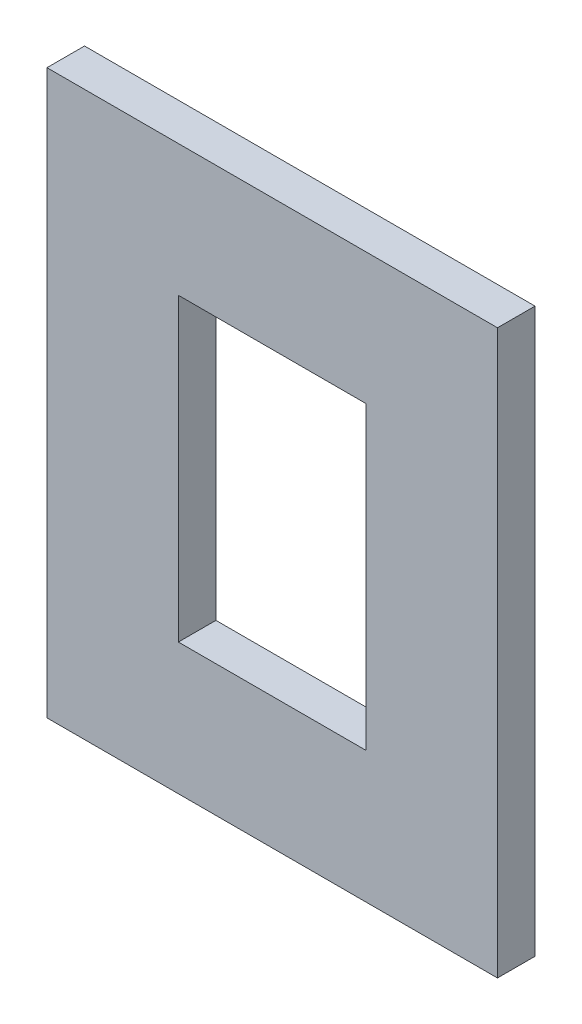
ISO-10303-21;
HEADER;
FILE_DESCRIPTION(('STEP AP214'),'2;1');
FILE_NAME('part.step','',(''),(''),'','','');
FILE_SCHEMA(('AUTOMOTIVE_DESIGN { 1 0 10303 214 1 1 1 1 }'));
ENDSEC;
DATA;
#1=APPLICATION_CONTEXT('core data for automotive mechanical design processes');
#2=APPLICATION_PROTOCOL_DEFINITION('international standard','automotive_design',2000,#1);
#3=PRODUCT_CONTEXT('',#1,'mechanical');
#4=PRODUCT('Part','Part','',(#3));
#5=PRODUCT_RELATED_PRODUCT_CATEGORY('part','',(#4));
#6=PRODUCT_DEFINITION_FORMATION('','',#4);
#7=PRODUCT_DEFINITION_CONTEXT('part definition',#1,'design');
#8=PRODUCT_DEFINITION('design','',#6,#7);
#9=PRODUCT_DEFINITION_SHAPE('','',#8);
#10=(LENGTH_UNIT() NAMED_UNIT(*) SI_UNIT(.MILLI.,.METRE.));
#11=(NAMED_UNIT(*) PLANE_ANGLE_UNIT() SI_UNIT($,.RADIAN.));
#12=(NAMED_UNIT(*) SI_UNIT($,.STERADIAN.) SOLID_ANGLE_UNIT());
#13=UNCERTAINTY_MEASURE_WITH_UNIT(LENGTH_MEASURE(1.E-05),#10,'distance_accuracy_value','');
#14=(GEOMETRIC_REPRESENTATION_CONTEXT(3) GLOBAL_UNCERTAINTY_ASSIGNED_CONTEXT((#13)) GLOBAL_UNIT_ASSIGNED_CONTEXT((#10,
#11,#12)) REPRESENTATION_CONTEXT('',''));
#15=CARTESIAN_POINT('',(0.,0.,0.));
#16=DIRECTION('',(0.,0.,1.));
#17=DIRECTION('',(1.,0.,0.));
#18=AXIS2_PLACEMENT_3D('',#15,#16,#17);
#19=CARTESIAN_POINT('',(76.2,95.25,-12.7));
#20=DIRECTION('',(1.,0.,0.));
#21=DIRECTION('',(0.,0.,-1.));
#22=AXIS2_PLACEMENT_3D('',#19,#20,#21);
#23=PLANE('',#22);
#24=DIRECTION('',(0.,1.,0.));
#25=VECTOR('',#24,1.);
#26=CARTESIAN_POINT('',(76.2,95.25,0.));
#27=LINE('',#26,#25);
#28=CARTESIAN_POINT('',(76.2,-95.25,0.));
#29=VERTEX_POINT('',#28);
#30=CARTESIAN_POINT('',(76.2,95.25,0.));
#31=VERTEX_POINT('',#30);
#32=EDGE_CURVE('E133',#29,#31,#27,.T.);
#33=ORIENTED_EDGE('',*,*,#32,.F.);
#34=DIRECTION('',(0.,0.,1.));
#35=VECTOR('',#34,1.);
#36=CARTESIAN_POINT('',(76.2,-95.25,-12.7));
#37=LINE('',#36,#35);
#38=CARTESIAN_POINT('',(76.2,-95.25,-12.7));
#39=VERTEX_POINT('',#38);
#40=EDGE_CURVE('E11',#39,#29,#37,.T.);
#41=ORIENTED_EDGE('',*,*,#40,.F.);
#42=DIRECTION('',(0.,1.,0.));
#43=VECTOR('',#42,1.);
#44=CARTESIAN_POINT('',(76.2,95.25,-12.7));
#45=LINE('',#44,#43);
#46=CARTESIAN_POINT('',(76.2,95.25,-12.7));
#47=VERTEX_POINT('',#46);
#48=EDGE_CURVE('E137',#39,#47,#45,.T.);
#49=ORIENTED_EDGE('',*,*,#48,.T.);
#50=DIRECTION('',(0.,0.,1.));
#51=VECTOR('',#50,1.);
#52=CARTESIAN_POINT('',(76.2,95.25,-12.7));
#53=LINE('',#52,#51);
#54=EDGE_CURVE('E38',#47,#31,#53,.T.);
#55=ORIENTED_EDGE('',*,*,#54,.T.);
#56=EDGE_LOOP('',(#33,#41,#49,#55));
#57=FACE_BOUND('',#56,.T.);
#58=ADVANCED_FACE('F35',(#57),#23,.T.);
#59=CARTESIAN_POINT('',(76.2,-95.25,-12.7));
#60=DIRECTION('',(0.,-1.,0.));
#61=DIRECTION('',(0.,0.,-1.));
#62=AXIS2_PLACEMENT_3D('',#59,#60,#61);
#63=PLANE('',#62);
#64=DIRECTION('',(1.,0.,0.));
#65=VECTOR('',#64,1.);
#66=CARTESIAN_POINT('',(76.2,-95.25,0.));
#67=LINE('',#66,#65);
#68=CARTESIAN_POINT('',(-76.2,-95.25,0.));
#69=VERTEX_POINT('',#68);
#70=EDGE_CURVE('E141',#69,#29,#67,.T.);
#71=ORIENTED_EDGE('',*,*,#70,.F.);
#72=DIRECTION('',(0.,0.,1.));
#73=VECTOR('',#72,1.);
#74=CARTESIAN_POINT('',(-76.2,-95.25,-12.7));
#75=LINE('',#74,#73);
#76=CARTESIAN_POINT('',(-76.2,-95.25,-12.7));
#77=VERTEX_POINT('',#76);
#78=EDGE_CURVE('E43',#77,#69,#75,.T.);
#79=ORIENTED_EDGE('',*,*,#78,.F.);
#80=DIRECTION('',(1.,0.,0.));
#81=VECTOR('',#80,1.);
#82=CARTESIAN_POINT('',(76.2,-95.25,-12.7));
#83=LINE('',#82,#81);
#84=EDGE_CURVE('E147',#77,#39,#83,.T.);
#85=ORIENTED_EDGE('',*,*,#84,.T.);
#86=ORIENTED_EDGE('',*,*,#40,.T.);
#87=EDGE_LOOP('',(#71,#79,#85,#86));
#88=FACE_BOUND('',#87,.T.);
#89=ADVANCED_FACE('F173',(#88),#63,.T.);
#90=CARTESIAN_POINT('',(-76.2,-95.25,-12.7));
#91=DIRECTION('',(-1.,0.,0.));
#92=DIRECTION('',(0.,0.,1.));
#93=AXIS2_PLACEMENT_3D('',#90,#91,#92);
#94=PLANE('',#93);
#95=DIRECTION('',(0.,-1.,0.));
#96=VECTOR('',#95,1.);
#97=CARTESIAN_POINT('',(-76.2,-95.25,0.));
#98=LINE('',#97,#96);
#99=CARTESIAN_POINT('',(-76.2,95.25,0.));
#100=VERTEX_POINT('',#99);
#101=EDGE_CURVE('E155',#100,#69,#98,.T.);
#102=ORIENTED_EDGE('',*,*,#101,.F.);
#103=DIRECTION('',(0.,0.,1.));
#104=VECTOR('',#103,1.);
#105=CARTESIAN_POINT('',(-76.2,95.25,-12.7));
#106=LINE('',#105,#104);
#107=CARTESIAN_POINT('',(-76.2,95.25,-12.7));
#108=VERTEX_POINT('',#107);
#109=EDGE_CURVE('E160',#108,#100,#106,.T.);
#110=ORIENTED_EDGE('',*,*,#109,.F.);
#111=DIRECTION('',(0.,-1.,0.));
#112=VECTOR('',#111,1.);
#113=CARTESIAN_POINT('',(-76.2,-95.25,-12.7));
#114=LINE('',#113,#112);
#115=EDGE_CURVE('E144',#108,#77,#114,.T.);
#116=ORIENTED_EDGE('',*,*,#115,.T.);
#117=ORIENTED_EDGE('',*,*,#78,.T.);
#118=EDGE_LOOP('',(#102,#110,#116,#117));
#119=FACE_BOUND('',#118,.T.);
#120=ADVANCED_FACE('F177',(#119),#94,.T.);
#121=CARTESIAN_POINT('',(-76.2,95.25,-12.7));
#122=DIRECTION('',(0.,1.,0.));
#123=DIRECTION('',(0.,0.,1.));
#124=AXIS2_PLACEMENT_3D('',#121,#122,#123);
#125=PLANE('',#124);
#126=DIRECTION('',(-1.,0.,0.));
#127=VECTOR('',#126,1.);
#128=CARTESIAN_POINT('',(-76.2,95.25,0.));
#129=LINE('',#128,#127);
#130=EDGE_CURVE('E152',#31,#100,#129,.T.);
#131=ORIENTED_EDGE('',*,*,#130,.F.);
#132=ORIENTED_EDGE('',*,*,#54,.F.);
#133=DIRECTION('',(-1.,0.,0.));
#134=VECTOR('',#133,1.);
#135=CARTESIAN_POINT('',(-76.2,95.25,-12.7));
#136=LINE('',#135,#134);
#137=EDGE_CURVE('E140',#47,#108,#136,.T.);
#138=ORIENTED_EDGE('',*,*,#137,.T.);
#139=ORIENTED_EDGE('',*,*,#109,.T.);
#140=EDGE_LOOP('',(#131,#132,#138,#139));
#141=FACE_BOUND('',#140,.T.);
#142=ADVANCED_FACE('F168',(#141),#125,.T.);
#143=CARTESIAN_POINT('',(0.,0.,-12.7));
#144=DIRECTION('',(0.,0.,-1.));
#145=DIRECTION('',(-1.,0.,0.));
#146=AXIS2_PLACEMENT_3D('',#143,#144,#145);
#147=PLANE('',#146);
#148=DIRECTION('',(0.,-1.,0.));
#149=VECTOR('',#148,1.);
#150=CARTESIAN_POINT('',(-31.75,-50.8,-12.7));
#151=LINE('',#150,#149);
#152=CARTESIAN_POINT('',(-31.75,50.8,-12.7));
#153=VERTEX_POINT('',#152);
#154=CARTESIAN_POINT('',(-31.75,-50.8,-12.7));
#155=VERTEX_POINT('',#154);
#156=EDGE_CURVE('E102',#153,#155,#151,.T.);
#157=ORIENTED_EDGE('',*,*,#156,.T.);
#158=DIRECTION('',(1.,0.,0.));
#159=VECTOR('',#158,1.);
#160=CARTESIAN_POINT('',(31.75,-50.8,-12.7));
#161=LINE('',#160,#159);
#162=CARTESIAN_POINT('',(31.75,-50.8,-12.7));
#163=VERTEX_POINT('',#162);
#164=EDGE_CURVE('E111',#155,#163,#161,.T.);
#165=ORIENTED_EDGE('',*,*,#164,.T.);
#166=DIRECTION('',(0.,1.,0.));
#167=VECTOR('',#166,1.);
#168=CARTESIAN_POINT('',(31.75,-50.8,-12.7));
#169=LINE('',#168,#167);
#170=CARTESIAN_POINT('',(31.75,50.8,-12.7));
#171=VERTEX_POINT('',#170);
#172=EDGE_CURVE('E51',#163,#171,#169,.T.);
#173=ORIENTED_EDGE('',*,*,#172,.T.);
#174=DIRECTION('',(-1.,0.,0.));
#175=VECTOR('',#174,1.);
#176=CARTESIAN_POINT('',(31.75,50.8,-12.7));
#177=LINE('',#176,#175);
#178=EDGE_CURVE('E108',#171,#153,#177,.T.);
#179=ORIENTED_EDGE('',*,*,#178,.T.);
#180=EDGE_LOOP('',(#157,#165,#173,#179));
#181=FACE_BOUND('',#180,.T.);
#182=ORIENTED_EDGE('',*,*,#48,.F.);
#183=ORIENTED_EDGE('',*,*,#84,.F.);
#184=ORIENTED_EDGE('',*,*,#115,.F.);
#185=ORIENTED_EDGE('',*,*,#137,.F.);
#186=EDGE_LOOP('',(#182,#183,#184,#185));
#187=FACE_BOUND('',#186,.T.);
#188=ADVANCED_FACE('F115',(#181,#187),#147,.T.);
#189=CARTESIAN_POINT('',(0.,0.,0.));
#190=DIRECTION('',(0.,0.,-1.));
#191=DIRECTION('',(-1.,0.,0.));
#192=AXIS2_PLACEMENT_3D('',#189,#190,#191);
#193=PLANE('',#192);
#194=DIRECTION('',(1.,0.,0.));
#195=VECTOR('',#194,1.);
#196=CARTESIAN_POINT('',(31.75,-50.8,0.));
#197=LINE('',#196,#195);
#198=CARTESIAN_POINT('',(-31.75,-50.8,0.));
#199=VERTEX_POINT('',#198);
#200=CARTESIAN_POINT('',(31.75,-50.8,0.));
#201=VERTEX_POINT('',#200);
#202=EDGE_CURVE('E127',#199,#201,#197,.T.);
#203=ORIENTED_EDGE('',*,*,#202,.F.);
#204=DIRECTION('',(0.,-1.,0.));
#205=VECTOR('',#204,1.);
#206=CARTESIAN_POINT('',(-31.75,-50.8,0.));
#207=LINE('',#206,#205);
#208=CARTESIAN_POINT('',(-31.75,50.8,0.));
#209=VERTEX_POINT('',#208);
#210=EDGE_CURVE('E59',#209,#199,#207,.T.);
#211=ORIENTED_EDGE('',*,*,#210,.F.);
#212=DIRECTION('',(-1.,0.,0.));
#213=VECTOR('',#212,1.);
#214=CARTESIAN_POINT('',(31.75,50.8,0.));
#215=LINE('',#214,#213);
#216=CARTESIAN_POINT('',(31.75,50.8,0.));
#217=VERTEX_POINT('',#216);
#218=EDGE_CURVE('E118',#217,#209,#215,.T.);
#219=ORIENTED_EDGE('',*,*,#218,.F.);
#220=DIRECTION('',(0.,1.,0.));
#221=VECTOR('',#220,1.);
#222=CARTESIAN_POINT('',(31.75,-50.8,0.));
#223=LINE('',#222,#221);
#224=EDGE_CURVE('E121',#201,#217,#223,.T.);
#225=ORIENTED_EDGE('',*,*,#224,.F.);
#226=EDGE_LOOP('',(#203,#211,#219,#225));
#227=FACE_BOUND('',#226,.T.);
#228=ORIENTED_EDGE('',*,*,#32,.T.);
#229=ORIENTED_EDGE('',*,*,#130,.T.);
#230=ORIENTED_EDGE('',*,*,#101,.T.);
#231=ORIENTED_EDGE('',*,*,#70,.T.);
#232=EDGE_LOOP('',(#228,#229,#230,#231));
#233=FACE_BOUND('',#232,.T.);
#234=ADVANCED_FACE('F170',(#227,#233),#193,.F.);
#235=CARTESIAN_POINT('',(-31.75,-50.8,-12.7));
#236=DIRECTION('',(-1.,0.,0.));
#237=DIRECTION('',(0.,0.,1.));
#238=AXIS2_PLACEMENT_3D('',#235,#236,#237);
#239=PLANE('',#238);
#240=ORIENTED_EDGE('',*,*,#210,.T.);
#241=DIRECTION('',(0.,0.,1.));
#242=VECTOR('',#241,1.);
#243=CARTESIAN_POINT('',(-31.75,-50.8,-12.7));
#244=LINE('',#243,#242);
#245=EDGE_CURVE('E98',#155,#199,#244,.T.);
#246=ORIENTED_EDGE('',*,*,#245,.F.);
#247=ORIENTED_EDGE('',*,*,#156,.F.);
#248=DIRECTION('',(0.,0.,1.));
#249=VECTOR('',#248,1.);
#250=CARTESIAN_POINT('',(-31.75,50.8,-12.7));
#251=LINE('',#250,#249);
#252=EDGE_CURVE('E131',#153,#209,#251,.T.);
#253=ORIENTED_EDGE('',*,*,#252,.T.);
#254=EDGE_LOOP('',(#240,#246,#247,#253));
#255=FACE_BOUND('',#254,.T.);
#256=ADVANCED_FACE('F100',(#255),#239,.F.);
#257=CARTESIAN_POINT('',(31.75,50.8,-12.7));
#258=DIRECTION('',(0.,1.,0.));
#259=DIRECTION('',(-1.,0.,0.));
#260=AXIS2_PLACEMENT_3D('',#257,#258,#259);
#261=PLANE('',#260);
#262=ORIENTED_EDGE('',*,*,#218,.T.);
#263=ORIENTED_EDGE('',*,*,#252,.F.);
#264=ORIENTED_EDGE('',*,*,#178,.F.);
#265=DIRECTION('',(0.,0.,1.));
#266=VECTOR('',#265,1.);
#267=CARTESIAN_POINT('',(31.75,50.8,-12.7));
#268=LINE('',#267,#266);
#269=EDGE_CURVE('E134',#171,#217,#268,.T.);
#270=ORIENTED_EDGE('',*,*,#269,.T.);
#271=EDGE_LOOP('',(#262,#263,#264,#270));
#272=FACE_BOUND('',#271,.T.);
#273=ADVANCED_FACE('F228',(#272),#261,.F.);
#274=CARTESIAN_POINT('',(31.75,-50.8,-12.7));
#275=DIRECTION('',(1.,0.,0.));
#276=DIRECTION('',(0.,0.,-1.));
#277=AXIS2_PLACEMENT_3D('',#274,#275,#276);
#278=PLANE('',#277);
#279=ORIENTED_EDGE('',*,*,#224,.T.);
#280=ORIENTED_EDGE('',*,*,#269,.F.);
#281=ORIENTED_EDGE('',*,*,#172,.F.);
#282=DIRECTION('',(0.,0.,1.));
#283=VECTOR('',#282,1.);
#284=CARTESIAN_POINT('',(31.75,-50.8,-12.7));
#285=LINE('',#284,#283);
#286=EDGE_CURVE('E107',#163,#201,#285,.T.);
#287=ORIENTED_EDGE('',*,*,#286,.T.);
#288=EDGE_LOOP('',(#279,#280,#281,#287));
#289=FACE_BOUND('',#288,.T.);
#290=ADVANCED_FACE('F237',(#289),#278,.F.);
#291=CARTESIAN_POINT('',(31.75,-50.8,-12.7));
#292=DIRECTION('',(0.,-1.,0.));
#293=DIRECTION('',(1.,0.,0.));
#294=AXIS2_PLACEMENT_3D('',#291,#292,#293);
#295=PLANE('',#294);
#296=ORIENTED_EDGE('',*,*,#202,.T.);
#297=ORIENTED_EDGE('',*,*,#286,.F.);
#298=ORIENTED_EDGE('',*,*,#164,.F.);
#299=ORIENTED_EDGE('',*,*,#245,.T.);
#300=EDGE_LOOP('',(#296,#297,#298,#299));
#301=FACE_BOUND('',#300,.T.);
#302=ADVANCED_FACE('F112',(#301),#295,.F.);
#303=CLOSED_SHELL('',(#58,#89,#120,#142,#188,#234,#256,#273,#290,#302));
#304=MANIFOLD_SOLID_BREP('B2',#303);
#305=ADVANCED_BREP_SHAPE_REPRESENTATION('',(#18,#304),#14);
#306=SHAPE_DEFINITION_REPRESENTATION(#9,#305);
ENDSEC;
END-ISO-10303-21;
